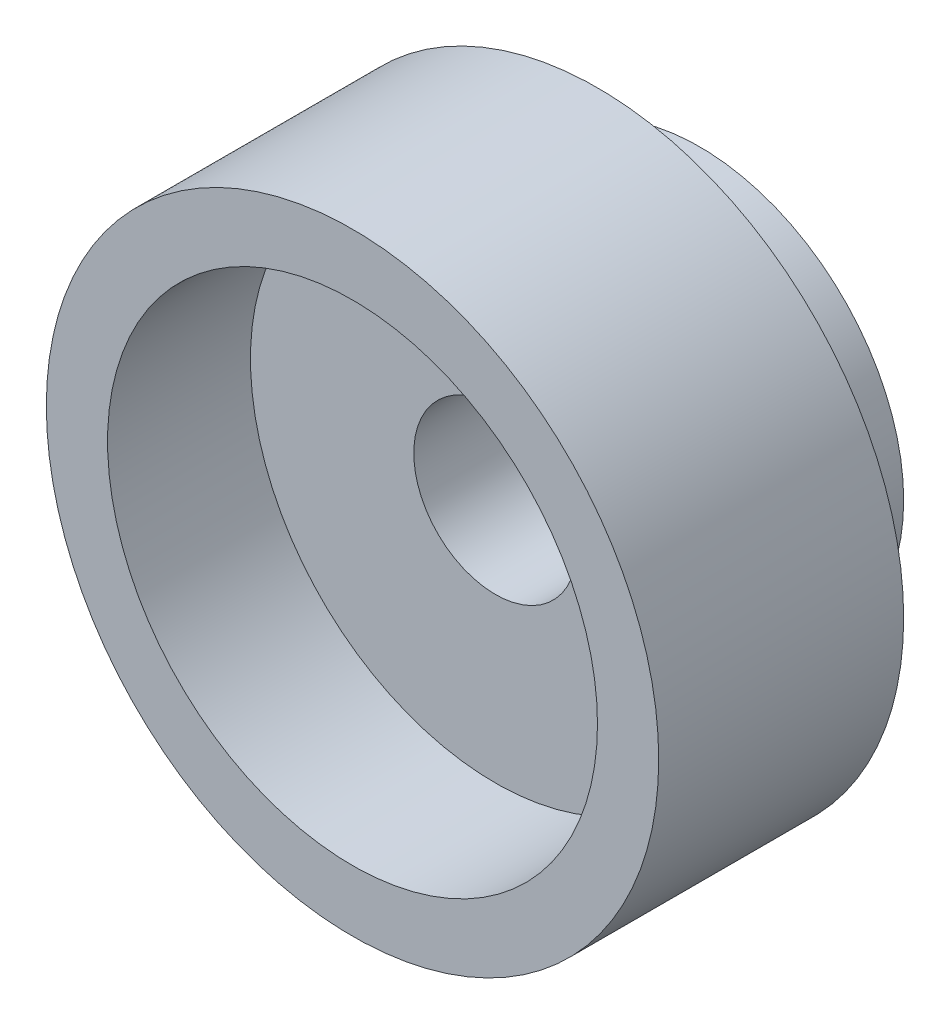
ISO-10303-21;
HEADER;
FILE_DESCRIPTION(('STEP AP214'),'2;1');
FILE_NAME('part.step','',(''),(''),'','','');
FILE_SCHEMA(('AUTOMOTIVE_DESIGN { 1 0 10303 214 1 1 1 1 }'));
ENDSEC;
DATA;
#1=APPLICATION_CONTEXT('core data for automotive mechanical design processes');
#2=APPLICATION_PROTOCOL_DEFINITION('international standard','automotive_design',2000,#1);
#3=PRODUCT_CONTEXT('',#1,'mechanical');
#4=PRODUCT('Part','Part','',(#3));
#5=PRODUCT_RELATED_PRODUCT_CATEGORY('part','',(#4));
#6=PRODUCT_DEFINITION_FORMATION('','',#4);
#7=PRODUCT_DEFINITION_CONTEXT('part definition',#1,'design');
#8=PRODUCT_DEFINITION('design','',#6,#7);
#9=PRODUCT_DEFINITION_SHAPE('','',#8);
#10=(LENGTH_UNIT() NAMED_UNIT(*) SI_UNIT(.MILLI.,.METRE.));
#11=(NAMED_UNIT(*) PLANE_ANGLE_UNIT() SI_UNIT($,.RADIAN.));
#12=(NAMED_UNIT(*) SI_UNIT($,.STERADIAN.) SOLID_ANGLE_UNIT());
#13=UNCERTAINTY_MEASURE_WITH_UNIT(LENGTH_MEASURE(1.E-05),#10,'distance_accuracy_value','');
#14=(GEOMETRIC_REPRESENTATION_CONTEXT(3) GLOBAL_UNCERTAINTY_ASSIGNED_CONTEXT((#13)) GLOBAL_UNIT_ASSIGNED_CONTEXT((#10,
#11,#12)) REPRESENTATION_CONTEXT('',''));
#15=CARTESIAN_POINT('',(0.,0.,0.));
#16=DIRECTION('',(0.,0.,1.));
#17=DIRECTION('',(1.,0.,0.));
#18=AXIS2_PLACEMENT_3D('',#15,#16,#17);
#19=CARTESIAN_POINT('',(0.,0.,20.));
#20=DIRECTION('',(0.,0.,1.));
#21=DIRECTION('',(1.,0.,0.));
#22=AXIS2_PLACEMENT_3D('',#19,#20,#21);
#23=CYLINDRICAL_SURFACE('',#22,10.);
#24=CARTESIAN_POINT('',(0.,0.,5.));
#25=DIRECTION('',(0.,0.,1.));
#26=DIRECTION('',(1.,0.,0.));
#27=AXIS2_PLACEMENT_3D('',#24,#25,#26);
#28=CIRCLE('',#27,10.);
#29=CARTESIAN_POINT('',(10.,0.,5.));
#30=VERTEX_POINT('',#29);
#31=EDGE_CURVE('E25',#30,#30,#28,.T.);
#32=ORIENTED_EDGE('',*,*,#31,.F.);
#33=EDGE_LOOP('',(#32));
#34=FACE_BOUND('',#33,.T.);
#35=CARTESIAN_POINT('',(0.,0.,0.));
#36=DIRECTION('',(0.,0.,1.));
#37=DIRECTION('',(1.,0.,0.));
#38=AXIS2_PLACEMENT_3D('',#35,#36,#37);
#39=CIRCLE('',#38,10.);
#40=CARTESIAN_POINT('',(10.,0.,0.));
#41=VERTEX_POINT('',#40);
#42=EDGE_CURVE('E8',#41,#41,#39,.T.);
#43=ORIENTED_EDGE('',*,*,#42,.T.);
#44=EDGE_LOOP('',(#43));
#45=FACE_BOUND('',#44,.T.);
#46=CARTESIAN_POINT('',(0.,10.,2.05));
#47=CARTESIAN_POINT('',(-0.0532331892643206,9.99999941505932,2.05000231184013));
#48=CARTESIAN_POINT('',(-0.106501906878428,9.99957041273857,2.05448943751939));
#49=CARTESIAN_POINT('',(-0.211563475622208,9.99790028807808,2.07232225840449));
#50=CARTESIAN_POINT('',(-0.263354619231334,9.99665826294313,2.08567780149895));
#51=CARTESIAN_POINT('',(-0.363924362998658,9.99350234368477,2.12085597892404));
#52=CARTESIAN_POINT('',(-0.412704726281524,9.99158884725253,2.14267360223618));
#53=CARTESIAN_POINT('',(-0.505900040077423,9.98730414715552,2.19414712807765));
#54=CARTESIAN_POINT('',(-0.550315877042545,9.98493303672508,2.22380143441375));
#55=CARTESIAN_POINT('',(-0.633677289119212,9.97999020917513,2.29021060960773));
#56=CARTESIAN_POINT('',(-0.672606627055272,9.97741793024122,2.32698582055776));
#57=CARTESIAN_POINT('',(-0.743750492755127,9.97236734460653,2.40654960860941));
#58=CARTESIAN_POINT('',(-0.775964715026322,9.96988904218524,2.44933845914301));
#59=CARTESIAN_POINT('',(-0.832820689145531,9.965301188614,2.53981559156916));
#60=CARTESIAN_POINT('',(-0.857447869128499,9.96319235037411,2.58751306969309));
#61=CARTESIAN_POINT('',(-0.898337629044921,9.95958901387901,2.68638963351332));
#62=CARTESIAN_POINT('',(-0.914600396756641,9.95809450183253,2.73756864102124));
#63=CARTESIAN_POINT('',(-0.938251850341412,9.95589401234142,2.84179068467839));
#64=CARTESIAN_POINT('',(-0.945667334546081,9.95518565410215,2.89482758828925));
#65=CARTESIAN_POINT('',(-0.951496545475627,9.95463024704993,3.00139759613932));
#66=CARTESIAN_POINT('',(-0.949910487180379,9.9547831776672,3.05493068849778));
#67=CARTESIAN_POINT('',(-0.93780374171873,9.95593089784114,3.16078908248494));
#68=CARTESIAN_POINT('',(-0.927312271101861,9.95692293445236,3.21311775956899));
#69=CARTESIAN_POINT('',(-0.89773795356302,9.95963278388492,3.31526815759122));
#70=CARTESIAN_POINT('',(-0.878655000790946,9.96135060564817,3.36508984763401));
#71=CARTESIAN_POINT('',(-0.832407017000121,9.96532163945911,3.4609045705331));
#72=CARTESIAN_POINT('',(-0.805228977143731,9.96757571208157,3.50689128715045));
#73=CARTESIAN_POINT('',(-0.743571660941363,9.97236452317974,3.59366156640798));
#74=CARTESIAN_POINT('',(-0.709092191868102,9.97489926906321,3.63444499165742));
#75=CARTESIAN_POINT('',(-0.633647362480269,9.97997608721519,3.70982080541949));
#76=CARTESIAN_POINT('',(-0.592656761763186,9.98251814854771,3.74438793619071));
#77=CARTESIAN_POINT('',(-0.505441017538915,9.98731363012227,3.80615431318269));
#78=CARTESIAN_POINT('',(-0.459215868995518,9.9895670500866,3.83335355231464));
#79=CARTESIAN_POINT('',(-0.362826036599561,9.9935319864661,3.87961086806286));
#80=CARTESIAN_POINT('',(-0.312660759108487,9.99524342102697,3.89866771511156));
#81=CARTESIAN_POINT('',(-0.20982269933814,9.99793069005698,3.92808104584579));
#82=CARTESIAN_POINT('',(-0.157149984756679,9.99890654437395,3.9384377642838));
#83=CARTESIAN_POINT('',(-0.0510110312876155,10.0000101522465,3.95012492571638));
#84=CARTESIAN_POINT('',(0.00245133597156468,10.0001411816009,3.95149023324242));
#85=CARTESIAN_POINT('',(0.108844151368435,9.99954914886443,3.94524731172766));
#86=CARTESIAN_POINT('',(0.161774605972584,9.99882609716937,3.93763919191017));
#87=CARTESIAN_POINT('',(0.265500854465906,9.99660927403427,3.9136942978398));
#88=CARTESIAN_POINT('',(0.3163004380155,9.99511693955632,3.89737379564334));
#89=CARTESIAN_POINT('',(0.414440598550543,9.99152904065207,3.85648410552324));
#90=CARTESIAN_POINT('',(0.461781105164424,9.98943346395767,3.83191474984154));
#91=CARTESIAN_POINT('',(0.551817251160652,9.98486548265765,3.77513795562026));
#92=CARTESIAN_POINT('',(0.594498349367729,9.98239195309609,3.74290754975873));
#93=CARTESIAN_POINT('',(0.673857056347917,9.97734939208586,3.67175656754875));
#94=CARTESIAN_POINT('',(0.710534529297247,9.97478035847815,3.63283583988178));
#95=CARTESIAN_POINT('',(0.776965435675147,9.96982652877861,3.54925716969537));
#96=CARTESIAN_POINT('',(0.806696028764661,9.96744235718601,3.50458103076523));
#97=CARTESIAN_POINT('',(0.858232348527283,9.96313750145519,3.41084974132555));
#98=CARTESIAN_POINT('',(0.880038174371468,9.96121681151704,3.36179464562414));
#99=CARTESIAN_POINT('',(0.915067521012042,9.9580601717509,3.2607770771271));
#100=CARTESIAN_POINT('',(0.92830475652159,9.95682312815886,3.2088193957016));
#101=CARTESIAN_POINT('',(0.945865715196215,9.95517036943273,3.10340655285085));
#102=CARTESIAN_POINT('',(0.950189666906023,9.95475463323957,3.04995142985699));
#103=CARTESIAN_POINT('',(0.949798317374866,9.95479196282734,2.94328810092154));
#104=CARTESIAN_POINT('',(0.945118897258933,9.95524157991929,2.89007975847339));
#105=CARTESIAN_POINT('',(0.926928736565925,9.9569516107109,2.7852085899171));
#106=CARTESIAN_POINT('',(0.913417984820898,9.95821202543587,2.7335457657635));
#107=CARTESIAN_POINT('',(0.877958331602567,9.96140069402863,2.63323160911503));
#108=CARTESIAN_POINT('',(0.856010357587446,9.96332887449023,2.5845799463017));
#109=CARTESIAN_POINT('',(0.804303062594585,9.96763596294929,2.49164554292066));
#110=CARTESIAN_POINT('',(0.774543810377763,9.97001486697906,2.44736276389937));
#111=CARTESIAN_POINT('',(0.70792385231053,9.97496669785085,2.36423929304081));
#112=CARTESIAN_POINT('',(0.67103644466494,9.97754033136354,2.32542004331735));
#113=CARTESIAN_POINT('',(0.591259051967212,9.98258517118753,2.25450598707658));
#114=CARTESIAN_POINT('',(0.548367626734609,9.98505635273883,2.2224127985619));
#115=CARTESIAN_POINT('',(0.457693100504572,9.98962366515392,2.16580500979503));
#116=CARTESIAN_POINT('',(0.409898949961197,9.99171891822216,2.14130805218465));
#117=CARTESIAN_POINT('',(0.310886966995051,9.99528855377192,2.10071934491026));
#118=CARTESIAN_POINT('',(0.259673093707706,9.99676364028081,2.0846180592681));
#119=CARTESIAN_POINT('',(0.173471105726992,9.99855352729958,2.06532008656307));
#120=CARTESIAN_POINT('',(0.139035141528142,9.9990934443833,2.05958283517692));
#121=CARTESIAN_POINT('',(0.069737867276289,9.99981687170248,2.05192204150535));
#122=CARTESIAN_POINT('',(0.0348765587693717,10.0000003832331,2.04999848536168));
#123=CARTESIAN_POINT('',(0.,10.,2.05));
#124=B_SPLINE_CURVE_WITH_KNOTS('',3,(#46,#47,#48,#49,#50,#51,#52,#53,#54,#55,#56,#57,#58,#59,
#60,#61,#62,#63,#64,#65,#66,#67,#68,#69,#70,#71,#72,#73,#74,#75,#76,#77,#78,#79,#80,#81,#82,#83,
#84,#85,#86,#87,#88,#89,#90,#91,#92,#93,#94,#95,#96,#97,#98,#99,#100,#101,#102,#103,#104,#105,
#106,#107,#108,#109,#110,#111,#112,#113,#114,#115,#116,#117,#118,#119,#120,#121,#122,#123),
.UNSPECIFIED.,.T.,.F.,(4,2,2,2,2,2,2,2,2,2,2,2,2,2,2,2,2,2,2,2,2,2,2,2,2,2,2,2,2,2,2,2,2,2,2,2,
2,2,4),(0.,0.159572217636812,0.319321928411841,0.478977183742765,0.638599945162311,
0.798685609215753,0.958778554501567,1.11917708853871,1.27957202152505,1.43947987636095,
1.59938391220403,1.75876535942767,1.91814877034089,2.07778970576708,2.23743485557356,
2.3977146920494,2.55799468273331,2.71829886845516,2.87859872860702,3.03827665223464,
3.19795263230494,3.35733142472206,3.51671345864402,3.67657947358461,3.83644910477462,
3.99683719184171,4.15722327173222,4.31735200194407,4.47747662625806,4.63696442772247,
4.79645243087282,4.95592290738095,5.11539198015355,5.27547042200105,5.43558732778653,
5.59607337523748,5.75637674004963,5.86092336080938,5.96546960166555),.UNSPECIFIED.);
#125=CARTESIAN_POINT('',(0.,10.,2.05));
#126=VERTEX_POINT('',#125);
#127=EDGE_CURVE('E49',#126,#126,#124,.T.);
#128=ORIENTED_EDGE('',*,*,#127,.F.);
#129=EDGE_LOOP('',(#128));
#130=FACE_BOUND('',#129,.T.);
#131=ADVANCED_FACE('F12',(#34,#45,#130),#23,.T.);
#132=CARTESIAN_POINT('',(0.,0.,20.));
#133=DIRECTION('',(0.,0.,1.));
#134=DIRECTION('',(1.,0.,0.));
#135=AXIS2_PLACEMENT_3D('',#132,#133,#134);
#136=CYLINDRICAL_SURFACE('',#135,4.);
#137=CARTESIAN_POINT('',(0.,0.,0.));
#138=DIRECTION('',(0.,0.,1.));
#139=DIRECTION('',(1.,0.,0.));
#140=AXIS2_PLACEMENT_3D('',#137,#138,#139);
#141=CIRCLE('',#140,4.);
#142=CARTESIAN_POINT('',(4.,0.,0.));
#143=VERTEX_POINT('',#142);
#144=EDGE_CURVE('E46',#143,#143,#141,.T.);
#145=ORIENTED_EDGE('',*,*,#144,.F.);
#146=EDGE_LOOP('',(#145));
#147=FACE_BOUND('',#146,.T.);
#148=CARTESIAN_POINT('',(0.,0.,10.));
#149=DIRECTION('',(0.,0.,1.));
#150=DIRECTION('',(1.,0.,0.));
#151=AXIS2_PLACEMENT_3D('',#148,#149,#150);
#152=CIRCLE('',#151,4.);
#153=CARTESIAN_POINT('',(4.,0.,10.));
#154=VERTEX_POINT('',#153);
#155=EDGE_CURVE('E43',#154,#154,#152,.T.);
#156=ORIENTED_EDGE('',*,*,#155,.T.);
#157=EDGE_LOOP('',(#156));
#158=FACE_BOUND('',#157,.T.);
#159=CARTESIAN_POINT('',(0.,4.,2.05));
#160=CARTESIAN_POINT('',(-0.0525716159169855,3.99999906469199,2.05000161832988));
#161=CARTESIAN_POINT('',(-0.105161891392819,3.99895317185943,2.05437856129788));
#162=CARTESIAN_POINT('',(-0.208840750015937,3.99488209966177,2.07174781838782));
#163=CARTESIAN_POINT('',(-0.259928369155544,3.99185567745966,2.08474554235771));
#164=CARTESIAN_POINT('',(-0.359089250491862,3.98415944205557,2.11892008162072));
#165=CARTESIAN_POINT('',(-0.407165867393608,3.97949149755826,2.14008759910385));
#166=CARTESIAN_POINT('',(-0.499084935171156,3.96901210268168,2.1899694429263));
#167=CARTESIAN_POINT('',(-0.542927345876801,3.96320064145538,2.21868384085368));
#168=CARTESIAN_POINT('',(-0.625954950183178,3.95094585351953,2.28341264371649));
#169=CARTESIAN_POINT('',(-0.665049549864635,3.9444935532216,2.31954156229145));
#170=CARTESIAN_POINT('',(-0.73668514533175,3.9317453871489,2.39782838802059));
#171=CARTESIAN_POINT('',(-0.769225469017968,3.92544953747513,2.43998691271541));
#172=CARTESIAN_POINT('',(-0.827243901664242,3.91363751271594,2.52982571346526));
#173=CARTESIAN_POINT('',(-0.852622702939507,3.90813277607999,2.57757176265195));
#174=CARTESIAN_POINT('',(-0.894959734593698,3.89865629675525,2.67680391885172));
#175=CARTESIAN_POINT('',(-0.911919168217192,3.89468433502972,2.72828949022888));
#176=CARTESIAN_POINT('',(-0.936630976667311,3.88881502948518,2.83254842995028));
#177=CARTESIAN_POINT('',(-0.944545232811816,3.88688125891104,2.88528133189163));
#178=CARTESIAN_POINT('',(-0.951445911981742,3.88519810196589,2.99135911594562));
#179=CARTESIAN_POINT('',(-0.950433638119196,3.88544839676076,3.04470390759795));
#180=CARTESIAN_POINT('',(-0.939639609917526,3.88807224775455,3.1492662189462));
#181=CARTESIAN_POINT('',(-0.930048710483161,3.89039959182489,3.20050477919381));
#182=CARTESIAN_POINT('',(-0.902673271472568,3.89684190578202,3.30062408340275));
#183=CARTESIAN_POINT('',(-0.884888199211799,3.90095699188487,3.34950467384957));
#184=CARTESIAN_POINT('',(-0.841461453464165,3.91055482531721,3.44404249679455));
#185=CARTESIAN_POINT('',(-0.815748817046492,3.91604983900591,3.48966583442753));
#186=CARTESIAN_POINT('',(-0.757246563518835,3.9277812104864,3.57601964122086));
#187=CARTESIAN_POINT('',(-0.724455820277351,3.93401768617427,3.6167493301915));
#188=CARTESIAN_POINT('',(-0.651730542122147,3.94672541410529,3.69325557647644));
#189=CARTESIAN_POINT('',(-0.611634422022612,3.95319858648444,3.72887839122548));
#190=CARTESIAN_POINT('',(-0.525961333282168,3.96550559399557,3.79292182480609));
#191=CARTESIAN_POINT('',(-0.480384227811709,3.97133941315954,3.82134226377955));
#192=CARTESIAN_POINT('',(-0.384836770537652,3.98173500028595,3.8702228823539));
#193=CARTESIAN_POINT('',(-0.334854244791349,3.98629308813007,3.89066009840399));
#194=CARTESIAN_POINT('',(-0.232031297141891,3.99359668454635,3.9228008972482));
#195=CARTESIAN_POINT('',(-0.179191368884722,3.99634250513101,3.93450598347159));
#196=CARTESIAN_POINT('',(-0.073469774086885,3.99966674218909,3.94862011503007));
#197=CARTESIAN_POINT('',(-0.0206175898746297,4.00029402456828,3.95123878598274));
#198=CARTESIAN_POINT('',(0.0847693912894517,3.99944875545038,3.94767789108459));
#199=CARTESIAN_POINT('',(0.137304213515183,3.99797637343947,3.94149903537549));
#200=CARTESIAN_POINT('',(0.239850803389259,3.9931283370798,3.92069175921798));
#201=CARTESIAN_POINT('',(0.289886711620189,3.98977804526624,3.90617587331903));
#202=CARTESIAN_POINT('',(0.386811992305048,3.98155050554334,3.86923361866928));
#203=CARTESIAN_POINT('',(0.433701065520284,3.97667311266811,3.8468064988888));
#204=CARTESIAN_POINT('',(0.523849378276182,3.96581376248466,3.79425957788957));
#205=CARTESIAN_POINT('',(0.56703672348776,3.95981504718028,3.76401998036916));
#206=CARTESIAN_POINT('',(0.647798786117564,3.94740789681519,3.69686149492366));
#207=CARTESIAN_POINT('',(0.685372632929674,3.94099939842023,3.65994157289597));
#208=CARTESIAN_POINT('',(0.754690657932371,3.92832194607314,3.57950145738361));
#209=CARTESIAN_POINT('',(0.786288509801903,3.92205915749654,3.53585400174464));
#210=CARTESIAN_POINT('',(0.841708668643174,3.91054099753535,3.44375060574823));
#211=CARTESIAN_POINT('',(0.865531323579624,3.90528558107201,3.39529488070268));
#212=CARTESIAN_POINT('',(0.904552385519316,3.89643241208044,3.29521491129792));
#213=CARTESIAN_POINT('',(0.919801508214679,3.89282493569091,3.24361134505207));
#214=CARTESIAN_POINT('',(0.94138348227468,3.88766286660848,3.13847559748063));
#215=CARTESIAN_POINT('',(0.947718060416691,3.88610787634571,3.08494379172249));
#216=CARTESIAN_POINT('',(0.951207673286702,3.88525500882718,2.9789541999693));
#217=CARTESIAN_POINT('',(0.948595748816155,3.88589982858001,2.92650441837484));
#218=CARTESIAN_POINT('',(0.934794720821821,3.88924263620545,2.82281582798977));
#219=CARTESIAN_POINT('',(0.92360575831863,3.89194059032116,2.7715769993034));
#220=CARTESIAN_POINT('',(0.893089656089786,3.89905535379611,2.67198987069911));
#221=CARTESIAN_POINT('',(0.873802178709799,3.90346377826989,2.62362877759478));
#222=CARTESIAN_POINT('',(0.827668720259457,3.91350473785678,2.5307964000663));
#223=CARTESIAN_POINT('',(0.800821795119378,3.91913742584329,2.48632560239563));
#224=CARTESIAN_POINT('',(0.739583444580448,3.93115888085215,2.40140051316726));
#225=CARTESIAN_POINT('',(0.70502846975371,3.93756238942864,2.36106622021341));
#226=CARTESIAN_POINT('',(0.629678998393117,3.95031159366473,2.28669268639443));
#227=CARTESIAN_POINT('',(0.588883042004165,3.95665727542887,2.25265492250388));
#228=CARTESIAN_POINT('',(0.501426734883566,3.96869602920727,2.19131638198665));
#229=CARTESIAN_POINT('',(0.454683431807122,3.97437711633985,2.16413136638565));
#230=CARTESIAN_POINT('',(0.357161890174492,3.98432297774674,2.11804816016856));
#231=CARTESIAN_POINT('',(0.306386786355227,3.98858883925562,2.09914360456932));
#232=CARTESIAN_POINT('',(0.213033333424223,3.99453812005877,2.07320058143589));
#233=CARTESIAN_POINT('',(0.170926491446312,3.9965728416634,2.06451822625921));
#234=CARTESIAN_POINT('',(0.0858838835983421,3.99930412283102,2.05291745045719));
#235=CARTESIAN_POINT('',(0.0429481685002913,4.00000076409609,2.04999867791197));
#236=CARTESIAN_POINT('',(0.,4.,2.05));
#237=B_SPLINE_CURVE_WITH_KNOTS('',3,(#159,#160,#161,#162,#163,#164,#165,#166,#167,#168,#169,
#170,#171,#172,#173,#174,#175,#176,#177,#178,#179,#180,#181,#182,#183,#184,#185,#186,#187,#188,
#189,#190,#191,#192,#193,#194,#195,#196,#197,#198,#199,#200,#201,#202,#203,#204,#205,#206,#207,
#208,#209,#210,#211,#212,#213,#214,#215,#216,#217,#218,#219,#220,#221,#222,#223,#224,#225,#226,
#227,#228,#229,#230,#231,#232,#233,#234,#235,#236),.UNSPECIFIED.,.T.,.F.,(4,2,2,2,2,2,2,2,2,2,2,
2,2,2,2,2,2,2,2,2,2,2,2,2,2,2,2,2,2,2,2,2,2,2,2,2,2,2,4),(0.,0.157557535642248,
0.315214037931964,0.472691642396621,0.630170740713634,0.790294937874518,0.950435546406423,
1.11269843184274,1.27493812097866,1.43422636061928,1.59349134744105,1.7492988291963,
1.90511644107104,2.06237145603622,2.21965150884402,2.38096351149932,2.54227954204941,
2.70405623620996,2.86580507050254,3.02379657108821,3.18177531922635,3.33767014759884,
3.49357977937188,3.65203889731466,3.81052256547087,3.97249049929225,4.13445118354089,
4.29544344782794,4.45640452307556,4.61320507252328,4.77000304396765,4.92604189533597,
5.08210024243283,5.24185280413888,5.40164279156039,5.56397421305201,5.72618063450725,
5.85490448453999,5.98362047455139),.UNSPECIFIED.);
#238=CARTESIAN_POINT('',(0.,4.,2.05));
#239=VERTEX_POINT('',#238);
#240=EDGE_CURVE('E16',#239,#239,#237,.T.);
#241=ORIENTED_EDGE('',*,*,#240,.T.);
#242=EDGE_LOOP('',(#241));
#243=FACE_BOUND('',#242,.T.);
#244=ADVANCED_FACE('F61',(#147,#158,#243),#136,.F.);
#245=CARTESIAN_POINT('',(-4.,0.,0.));
#246=DIRECTION('',(0.,0.,1.));
#247=DIRECTION('',(1.,0.,0.));
#248=AXIS2_PLACEMENT_3D('',#245,#246,#247);
#249=PLANE('',#248);
#250=ORIENTED_EDGE('',*,*,#42,.F.);
#251=EDGE_LOOP('',(#250));
#252=FACE_BOUND('',#251,.T.);
#253=ORIENTED_EDGE('',*,*,#144,.T.);
#254=EDGE_LOOP('',(#253));
#255=FACE_BOUND('',#254,.T.);
#256=ADVANCED_FACE('F14',(#252,#255),#249,.F.);
#257=CARTESIAN_POINT('',(-10.,0.,5.));
#258=DIRECTION('',(0.,0.,1.));
#259=DIRECTION('',(1.,0.,0.));
#260=AXIS2_PLACEMENT_3D('',#257,#258,#259);
#261=PLANE('',#260);
#262=CARTESIAN_POINT('',(0.,0.,5.));
#263=DIRECTION('',(0.,0.,1.));
#264=DIRECTION('',(1.,0.,0.));
#265=AXIS2_PLACEMENT_3D('',#262,#263,#264);
#266=CIRCLE('',#265,15.);
#267=CARTESIAN_POINT('',(15.,0.,5.));
#268=VERTEX_POINT('',#267);
#269=EDGE_CURVE('E29',#268,#268,#266,.T.);
#270=ORIENTED_EDGE('',*,*,#269,.F.);
#271=EDGE_LOOP('',(#270));
#272=FACE_BOUND('',#271,.T.);
#273=ORIENTED_EDGE('',*,*,#31,.T.);
#274=EDGE_LOOP('',(#273));
#275=FACE_BOUND('',#274,.T.);
#276=ADVANCED_FACE('F80',(#272,#275),#261,.F.);
#277=CARTESIAN_POINT('',(0.,0.,20.));
#278=DIRECTION('',(0.,0.,1.));
#279=DIRECTION('',(1.,0.,0.));
#280=AXIS2_PLACEMENT_3D('',#277,#278,#279);
#281=CYLINDRICAL_SURFACE('',#280,15.);
#282=ORIENTED_EDGE('',*,*,#269,.T.);
#283=EDGE_LOOP('',(#282));
#284=FACE_BOUND('',#283,.T.);
#285=CARTESIAN_POINT('',(0.,0.,17.));
#286=DIRECTION('',(0.,0.,1.));
#287=DIRECTION('',(1.,0.,0.));
#288=AXIS2_PLACEMENT_3D('',#285,#286,#287);
#289=CIRCLE('',#288,15.);
#290=CARTESIAN_POINT('',(15.,0.,17.));
#291=VERTEX_POINT('',#290);
#292=EDGE_CURVE('E34',#291,#291,#289,.T.);
#293=ORIENTED_EDGE('',*,*,#292,.F.);
#294=EDGE_LOOP('',(#293));
#295=FACE_BOUND('',#294,.T.);
#296=ADVANCED_FACE('F77',(#284,#295),#281,.T.);
#297=CARTESIAN_POINT('',(-12.,0.,17.));
#298=DIRECTION('',(0.,0.,1.));
#299=DIRECTION('',(1.,0.,0.));
#300=AXIS2_PLACEMENT_3D('',#297,#298,#299);
#301=PLANE('',#300);
#302=ORIENTED_EDGE('',*,*,#292,.T.);
#303=EDGE_LOOP('',(#302));
#304=FACE_BOUND('',#303,.T.);
#305=CARTESIAN_POINT('',(0.,0.,17.));
#306=DIRECTION('',(0.,0.,1.));
#307=DIRECTION('',(1.,0.,0.));
#308=AXIS2_PLACEMENT_3D('',#305,#306,#307);
#309=CIRCLE('',#308,12.);
#310=CARTESIAN_POINT('',(12.,0.,17.));
#311=VERTEX_POINT('',#310);
#312=EDGE_CURVE('E37',#311,#311,#309,.T.);
#313=ORIENTED_EDGE('',*,*,#312,.F.);
#314=EDGE_LOOP('',(#313));
#315=FACE_BOUND('',#314,.T.);
#316=ADVANCED_FACE('F73',(#304,#315),#301,.T.);
#317=CARTESIAN_POINT('',(0.,0.,20.));
#318=DIRECTION('',(0.,0.,1.));
#319=DIRECTION('',(1.,0.,0.));
#320=AXIS2_PLACEMENT_3D('',#317,#318,#319);
#321=CYLINDRICAL_SURFACE('',#320,12.);
#322=ORIENTED_EDGE('',*,*,#312,.T.);
#323=EDGE_LOOP('',(#322));
#324=FACE_BOUND('',#323,.T.);
#325=CARTESIAN_POINT('',(0.,0.,10.));
#326=DIRECTION('',(0.,0.,1.));
#327=DIRECTION('',(1.,0.,0.));
#328=AXIS2_PLACEMENT_3D('',#325,#326,#327);
#329=CIRCLE('',#328,12.);
#330=CARTESIAN_POINT('',(12.,0.,10.));
#331=VERTEX_POINT('',#330);
#332=EDGE_CURVE('E40',#331,#331,#329,.T.);
#333=ORIENTED_EDGE('',*,*,#332,.F.);
#334=EDGE_LOOP('',(#333));
#335=FACE_BOUND('',#334,.T.);
#336=ADVANCED_FACE('F69',(#324,#335),#321,.F.);
#337=CARTESIAN_POINT('',(-4.,0.,10.));
#338=DIRECTION('',(0.,0.,1.));
#339=DIRECTION('',(1.,0.,0.));
#340=AXIS2_PLACEMENT_3D('',#337,#338,#339);
#341=PLANE('',#340);
#342=ORIENTED_EDGE('',*,*,#332,.T.);
#343=EDGE_LOOP('',(#342));
#344=FACE_BOUND('',#343,.T.);
#345=ORIENTED_EDGE('',*,*,#155,.F.);
#346=EDGE_LOOP('',(#345));
#347=FACE_BOUND('',#346,.T.);
#348=ADVANCED_FACE('F59',(#344,#347),#341,.T.);
#349=CARTESIAN_POINT('',(0.,10.,3.));
#350=DIRECTION('',(0.,-1.,0.));
#351=DIRECTION('',(0.,0.,-1.));
#352=AXIS2_PLACEMENT_3D('',#349,#350,#351);
#353=CYLINDRICAL_SURFACE('',#352,0.95);
#354=ORIENTED_EDGE('',*,*,#240,.F.);
#355=EDGE_LOOP('',(#354));
#356=FACE_BOUND('',#355,.T.);
#357=ORIENTED_EDGE('',*,*,#127,.T.);
#358=EDGE_LOOP('',(#357));
#359=FACE_BOUND('',#358,.T.);
#360=ADVANCED_FACE('F56',(#356,#359),#353,.F.);
#361=CLOSED_SHELL('',(#131,#244,#256,#276,#296,#316,#336,#348,#360));
#362=MANIFOLD_SOLID_BREP('B1',#361);
#363=ADVANCED_BREP_SHAPE_REPRESENTATION('',(#18,#362),#14);
#364=SHAPE_DEFINITION_REPRESENTATION(#9,#363);
ENDSEC;
END-ISO-10303-21;
